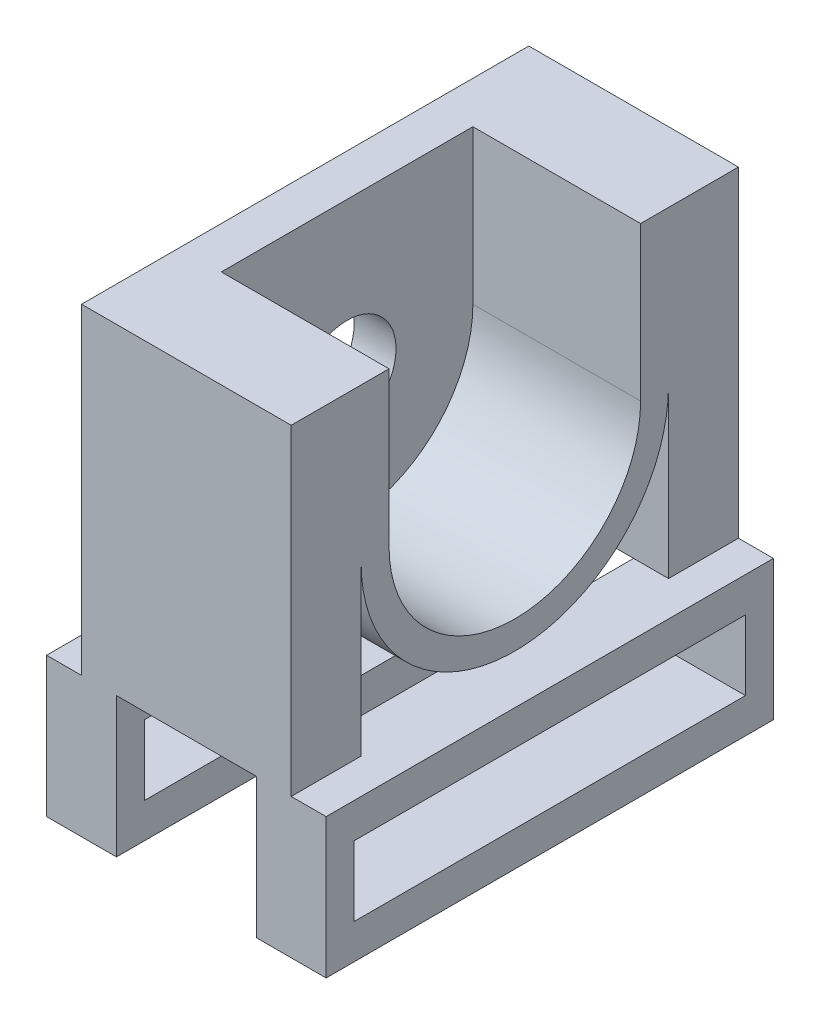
from build123d import *

# Parameters (mm, degrees)
BOSS_EXTRUDE2_DEPTH  = 15
CUT_EXTRUDE1_DEPTH   = 12
SKETCH3_R            = 3.5
CUT_EXTRUDE2_DEPTH   = 20.646882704
SKETCH4_W            = 15
SKETCH4_H            = 11
BOSS_EXTRUDE3_DEPTH  = 5
SKETCH5_W            = 15
SKETCH5_H            = 5
BOSS_EXTRUDE5_DEPTH  = 16
SKETCH6_W            = 15
SKETCH6_H            = 11
BOSS_EXTRUDE6_DEPTH  = 5
SKETCH7_W            = 15
SKETCH7_H            = 5
BOSS_EXTRUDE7_DEPTH  = 16
SKETCH9_W            = 15
SKETCH9_H            = 5
BOSS_EXTRUDE8_DEPTH  = 6
BOSS_EXTRUDE15_REACH = 39.921
SKETCH13_W           = 15
SKETCH13_H           = 10
SKETCH14_W           = 32
SKETCH14_H           = 10
BOSS_EXTRUDE16_DEPTH = 2.5
SKETCH15_W           = 32
SKETCH15_H           = 10
BOSS_EXTRUDE17_DEPTH = 2.5
SKETCH16_W           = 28
SKETCH16_H           = 5
CUT_EXTRUDE4_DEPTH   = 34.763886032
SKETCH17_W           = 10
SKETCH17_H           = 10
CUT_EXTRUDE5_DEPTH   = 43.594013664


with BuildPart() as part:
    # Sketch1 → Boss-Extrude2 (new body)
    with BuildSketch(Plane(origin=(0, 0, 0), x_dir=(0, 0, -1), z_dir=(1, 0, 0))):
        with BuildLine():
            Line((-11, 0), (-11, 11))
            Line((-11, 11), (11, 11))
            Line((11, 11), (11, 0))
            ThreePointArc((11, 0), (0, -11), (-11, 0))
        make_face()
    extrude(amount=BOSS_EXTRUDE2_DEPTH)

    # Sketch2 → Cut-Extrude1 (cut)
    with BuildSketch(Plane(origin=(15, 0, 0), x_dir=(0, 0, -1), z_dir=(1, 0, 0))):
        with BuildLine():
            Line((-9, 0), (-9, 11))
            Line((-9, 11), (9, 11))
            Line((9, 11), (9, 0))
            ThreePointArc((9, 0), (0, -9), (-9, 0))
        make_face()
    extrude(amount=-CUT_EXTRUDE1_DEPTH, mode=Mode.SUBTRACT)

    # Sketch3 → Cut-Extrude2 (cut, through all)
    with BuildSketch(Plane(origin=(3, 0, 0), x_dir=(0, 0, -1), z_dir=(1, 0, 0))):
        Circle(SKETCH3_R)
    extrude(amount=-CUT_EXTRUDE2_DEPTH, mode=Mode.SUBTRACT)

    # Sketch4 → Boss-Extrude3 (add)
    with BuildSketch(Plane(origin=(0, 0, -11), x_dir=(-1, 0, 0), z_dir=(0, 0, -1))):
        with Locations((-7.5, 5.5)):
            Rectangle(SKETCH4_W, SKETCH4_H)
    extrude(amount=BOSS_EXTRUDE3_DEPTH)

    # Sketch5 → Boss-Extrude5 (add)
    with BuildSketch(Plane.XZ):
        with Locations((7.5, -13.5)):
            Rectangle(SKETCH5_W, SKETCH5_H)
    extrude(amount=BOSS_EXTRUDE5_DEPTH)

    # Sketch6 → Boss-Extrude6 (add)
    with BuildSketch(Plane.XY.offset(11)):
        with Locations((7.5, 5.5)):
            Rectangle(SKETCH6_W, SKETCH6_H)
    extrude(amount=BOSS_EXTRUDE6_DEPTH)

    # Sketch7 → Boss-Extrude7 (add)
    with BuildSketch(Plane.XZ):
        with Locations((7.5, 13.5)):
            Rectangle(SKETCH7_W, SKETCH7_H)
    extrude(amount=BOSS_EXTRUDE7_DEPTH)

    # Sketch9 → Boss-Extrude8 (add)
    with BuildSketch(Plane.XZ.offset(16)):
        with Locations((7.5, 13.5)):
            Rectangle(SKETCH9_W, SKETCH9_H)
        with Locations((7.5, -13.5)):
            Rectangle(SKETCH9_W, SKETCH9_H)
    extrude(amount=BOSS_EXTRUDE8_DEPTH)

    # Sketch13 → Boss-Extrude15 (add, up to next)
    with BuildSketch(Plane(origin=(0, 0, 11), x_dir=(-1, 0, 0), z_dir=(0, 0, -1)), mode=Mode.PRIVATE) as boss_extrude15_sk1:
        with Locations((-7.5, -17)):
            Rectangle(SKETCH13_W, SKETCH13_H)
    boss_extrude15_tool1 = extrude(boss_extrude15_sk1.sketch, amount=BOSS_EXTRUDE15_REACH, mode=Mode.PRIVATE) - part.part
    add(boss_extrude15_tool1.solids().sort_by_distance((7.5, -17, 11))[0])

    # Sketch14 → Boss-Extrude16 (add)
    with BuildSketch(Plane(origin=(15, 0, 0), x_dir=(0, 0, -1), z_dir=(1, 0, 0))):
        with Locations((0, -17)):
            Rectangle(SKETCH14_W, SKETCH14_H)
    extrude(amount=BOSS_EXTRUDE16_DEPTH)

    # Sketch15 → Boss-Extrude17 (add)
    with BuildSketch(Plane.ZY):
        with Locations((0, -17)):
            Rectangle(SKETCH15_W, SKETCH15_H)
    extrude(amount=BOSS_EXTRUDE17_DEPTH)

    # Sketch16 → Cut-Extrude4 (cut, through all)
    with BuildSketch(Plane.ZY.offset(2.5)):
        with Locations((0, -17)):
            Rectangle(SKETCH16_W, SKETCH16_H)
    extrude(amount=-CUT_EXTRUDE4_DEPTH, mode=Mode.SUBTRACT)

    # Sketch17 → Cut-Extrude5 (cut, through all)
    with BuildSketch(Plane.XY.offset(16)):
        with Locations((7.5, -17)):
            Rectangle(SKETCH17_W, SKETCH17_H)
    extrude(amount=-CUT_EXTRUDE5_DEPTH, mode=Mode.SUBTRACT)


solid = part.part
